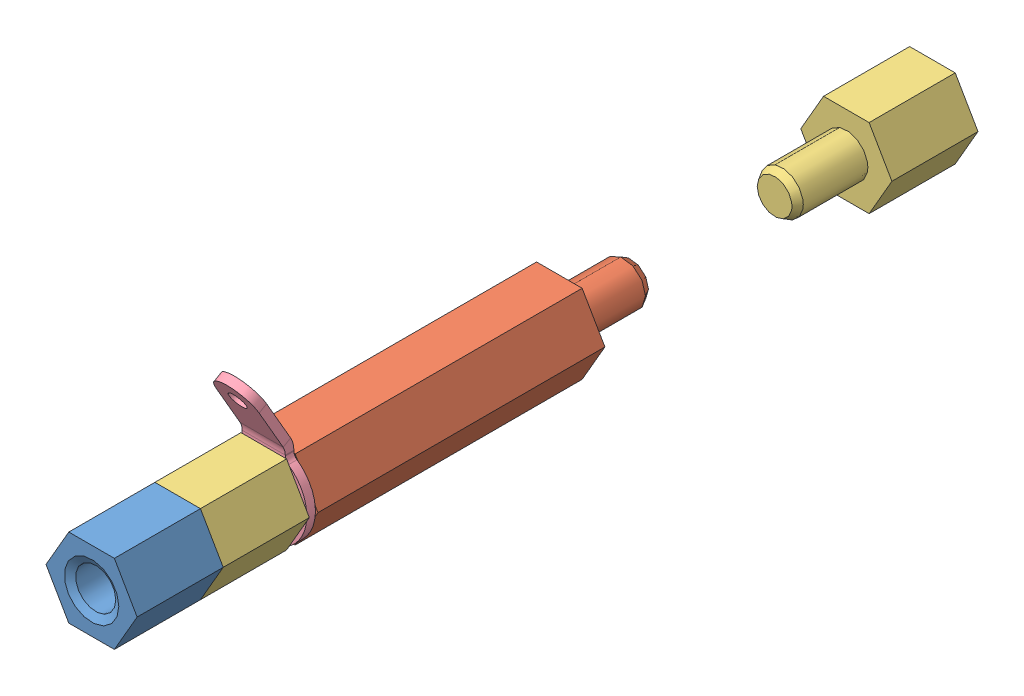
SolidWorks assembly A6303 CB.SLDASM, configuration Default (file format 13000). Lengths in mm.
Overall size (7.94 12.11 58.6).
6 component instances, 5 part files, 14 mates.
Components (placement in the parent):
- Space Plastic M3x6 MF-1: Space Plastic M3x6 MF.SLDPRT [Default] at origin size (6.35 5.5 11)
- Space M3x20 FF-1: Space M3x20 FF.SLDPRT [Default] at (0 0 -36.6) x (-0.5 -0.866025 0) z (0 0 1) size (6.35 5.5 20)
- Space M3x20 MF-1: Space M3x20 MF.SLDPRT [Default] at (0 0 -26.6) size (6.35 5.5 25)
- Space M3x6 MF-1: Space M3x6 MF.SLDPRT [Default] at (0 0 -6) x (0.5 0.866025 0) z (0 0 1) size (6.35 5.5 11)
- Space M3x6 MF-2: Space M3x6 MF.SLDPRT [Default] at (0 0 -46.6) x (-1 0 0) z (0 0 -1) size (6.35 5.5 11)
- M3 tab-1: M3 tab.SLDPRT [Default] at (0 0 -6) size (6 10.99 3.17)
Mates (geometry in assembly coordinates):
- Concentric1: concentric aligned: cylinder of Space Plastic M3x6 MF-1 through (0 0 -5) axis (0 0 1) radius 1.5; cylinder of Space M3x6 MF-1 through (0 0 -11) axis (0 0 1) radius 1.5
- Concentric2: concentric aligned: cylinder of Space M3x20 MF-1 through (0 0 -12.6) axis (0 0 1) radius 1.4; cylinder of Space M3x6 MF-1 through (0 0 -11) axis (0 0 1) radius 1.5
- Concentric3: concentric aligned: cylinder of Space M3x20 MM-1 through (0 0 -32.6) axis (0 0 1) radius 1.4; cylinder of Space M3x20 MF-1 through (0 0 -31.6) axis (0 0 1) radius 1.5
- Coincident1: coincident anti-aligned: plane of Space M3x20 MM-1 through (0 0 -26.6) normal (0 0 1); plane of Space M3x20 MF-1 through (0 0 -26.6) normal (0 0 -1)
- Concentric4: concentric aligned: cylinder of Space M3x20 MM-1 through (0 0 -40.6) axis (0 0 -1) radius 1.4; cylinder of Space M3x6 MF-2 through (0 0 -41.6) axis (0 0 -1) radius 1.5
- Coincident3: coincident anti-aligned: plane of Space M3x20 MM-1 through (0 0 -46.6) normal (0 0 -1); plane of Space M3x6 MF-2 through (0 0 -46.6) normal (0 0 1)
- Concentric5: concentric aligned: cylinder of Space Plastic M3x6 MF-1 through (0 0 -5) axis (0 0 1) radius 1.5; cylinder of M3 tab-1 through (0 0 -6.6) axis (0 0 1) radius 1.55
- Coincident6: coincident anti-aligned: plane of Space Plastic M3x6 MF-1 through (0 0 0) normal (0 0 -1); plane of Space M3x6 MF-1 through (0 0 0) normal (0 0 1)
- Coincident7: coincident anti-aligned: plane of Space M3x6 MF-1 through (0 0 -6) normal (0 0 -1); plane of M3 tab-1 through (0 7 -6) normal (0 0 1)
- Coincident8: coincident anti-aligned: plane of Space M3x20 MF-1 through (0 0 -6.6) normal (0 0 1); plane of M3 tab-1 through (0 7 -6.6) normal (0 0 -1)
- Coincident9: coincident aligned: plane of Space M3x20 MM-1 through (3.1754 0 -26.6) normal (0.866025 0.5 0); plane of Space M3x6 MF-2 through (1.5877 2.75 -52.6) normal (0.866025 0.5 0)
- Coincident10: coincident aligned: plane of Space M3x20 MM-1 through (3.1754 0 -26.6) normal (0.866025 0.5 0); plane of Space M3x20 MF-1 through (3.1754 0 -6.6) normal (0.866025 0.5 0)
- Coincident11: coincident aligned: plane of Space M3x20 MF-1 through (3.1754 0 -6.6) normal (0.866025 0.5 0); plane of Space M3x6 MF-1 through (3.1754 0 0) normal (0.866025 0.5 0)
- Coincident12: coincident aligned: plane of Space Plastic M3x6 MF-1 through (3.1754 0 6) normal (0.866025 0.5 0); plane of Space M3x6 MF-1 through (3.1754 0 0) normal (0.866025 0.5 0)
